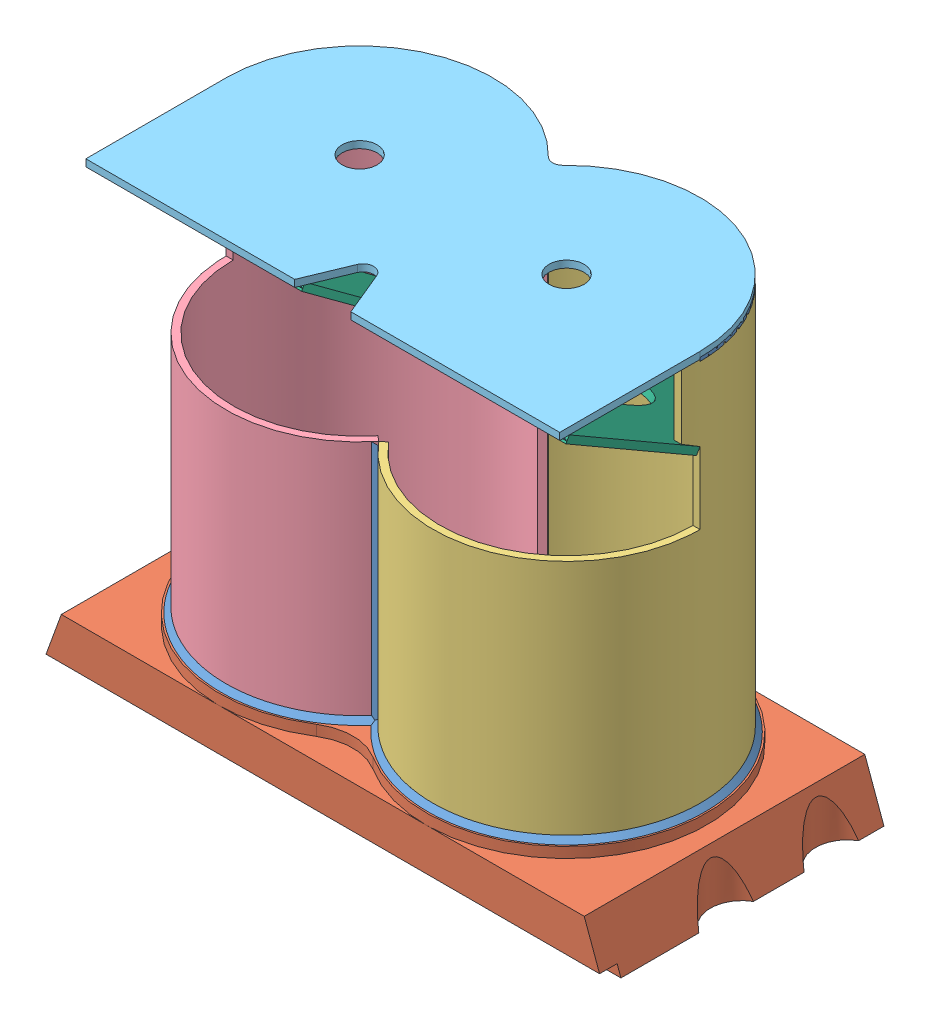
SolidWorks assembly MONTAGE-CLAPET-COLLECT-BF600L_ASM.sldasm, configuration Défaut (file format 7000). Lengths in mm.
Overall size (160 131 80).
6 component instances, 6 part files, 0 mates.
Components (placement in the parent):
- MONTAGE-CLAPET-COLLECT-BF600L_ASM-1: MONTAGE-CLAPET-COLLECT-BF600L_ASM.sldprt [Défaut] at origin size (138.31 114.5 79.04)
- BRIDE-DOUBLE-COLLECT-BF600L-1: BRIDE-DOUBLE-COLLECT-BF600L.sldprt [Défaut] at origin size (160 18 80)
- CYLINDRE-AV-GAUCHE-COLL-BF600L-1: CYLINDRE-AV-GAUCHE-COLL-BF600L.sldprt [Défaut] at (29.5 129 0) x (-1 0 0) z (0 0 1) size (67.56 114 76.1)
- CYLINDRE-AV-DROIT-COLL-BF600L-1: CYLINDRE-AV-DROIT-COLL-BF600L.sldprt [Défaut] at (-29.5 129 0) x (1 0 0) z (0 0 -1) size (67.56 114 76.1)
- TOLE-FOND-CLAPET-AV-COLL-BF600L-1: TOLE-FOND-CLAPET-AV-COLL-BF600L.sldprt [Défaut] at (0 129 0) x (0 0 -1) z (1 0 0) size (78.05 2 135.1)
- DIFFUSEUR-FLUX-SUP-1: DIFFUSEUR-FLUX-SUP.sldprt [Défaut] at (0 127.2679 38.2391) x (1 0 0) z (0 0.5 0.866025) size (135.1 2 83.84)
